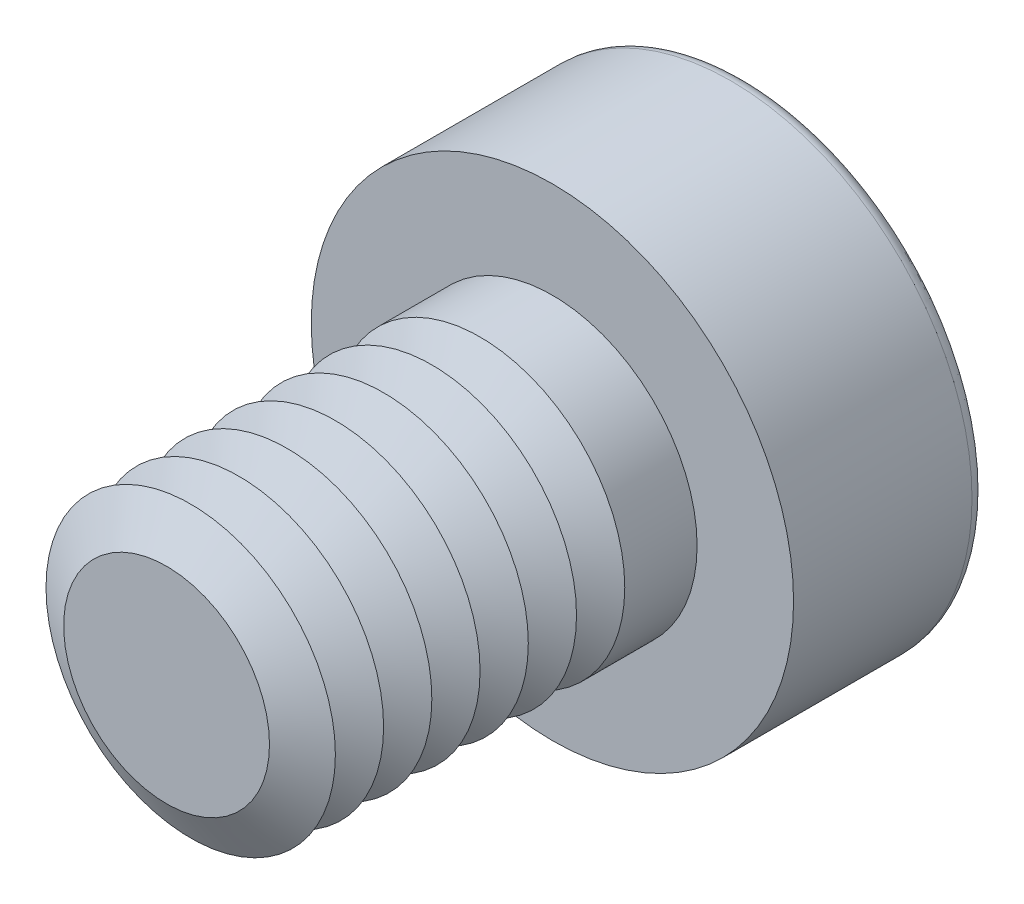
from build123d import *

# Parameters (mm, degrees)
SKETCH1_R           = 3
BOSS_EXTRUDE1_DEPTH = 8
SKETCH2_R           = 5
BOSS_EXTRUDE2_DEPTH = 4
CUT_EXTRUDE1_DEPTH  = 3
FILLET1_R           = 0.3
LPATTERN1_COUNT     = 7
LPATTERN1_PITCH     = 1


with BuildPart() as part:
    # Sketch1 → Boss-Extrude1 (new body)
    with BuildSketch(Plane.XY):
        Circle(SKETCH1_R)
    extrude(amount=BOSS_EXTRUDE1_DEPTH)

    # Sketch2 → Boss-Extrude2 (add)
    with BuildSketch(Plane(origin=(0, 0, 0), x_dir=(-1, 0, 0), z_dir=(0, 0, -1))):
        Circle(SKETCH2_R)
    extrude(amount=BOSS_EXTRUDE2_DEPTH)

    # Sketch3 → Cut-Extrude1 (cut)
    with BuildSketch(Plane(origin=(0, 0, -4), x_dir=(-1, 0, 0), z_dir=(0, 0, -1))):
        Polygon((-1.154700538, 2), (-2.309401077, 0), (-1.154700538, -2), (1.154700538, -2), (2.309401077, 0), (1.154700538, 2), align=None)
    extrude(amount=-CUT_EXTRUDE1_DEPTH, mode=Mode.SUBTRACT)

    # Fillet1
    fillet1_edges = [part.edges().sort_by_distance(p)[0] for p in [
        (5, 0, -4),
    ]]
    fillet(fillet1_edges, radius=FILLET1_R)

    # Cut-Extrude2 cone 1 section (on through the dimple's axis) → Cut-Extrude2 (revolve, cut)
    with BuildSketch(Plane(origin=(0, 0, -1), x_dir=(0, 1, 0), z_dir=(1, 0, 0))):
        Polygon((0, 0), (2, 0), (0, 1.154700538), align=None)
    revolve(axis=Axis((0, 0, -1), (0, 0, 1)), mode=Mode.SUBTRACT)

    # Cut-Extrude3 cone 1 section (on through the dimple's axis) → Cut-Extrude3 (revolve, cut)
    with BuildSketch(Plane(origin=(0, 0, -4), x_dir=(0, 1, 0), z_dir=(1, 0, 0))):
        Polygon((0, 0), (2.309401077, 0), (0, 0.618802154), align=None)
    revolve(axis=Axis((0, 0, -4), (0, 0, 1)), mode=Mode.SUBTRACT)

    # Sketch7 → Cut-Revolve1 (revolve, cut)
    with BuildSketch(Plane(origin=(0, 0, 0), x_dir=(0, 0, -1), z_dir=(1, 0, 0)), mode=Mode.PRIVATE) as cut_revolve1_sk:
        Polygon((-8, 2.133974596), (-7.5, 3), (-8.5, 3), align=None)
    cut_revolve1 = revolve(cut_revolve1_sk.sketch.rotate(Axis((0, 0, 8), (0, 0, -1)), 90), axis=Axis((0, 0, 8), (0, 0, -1)), mode=Mode.SUBTRACT)

    # LPattern1: Cut-Revolve1 ×7
    with Locations(*[(0, 0, -i * LPATTERN1_PITCH) for i in range(1, LPATTERN1_COUNT)]):
        add(cut_revolve1, mode=Mode.SUBTRACT)


solid = part.part
